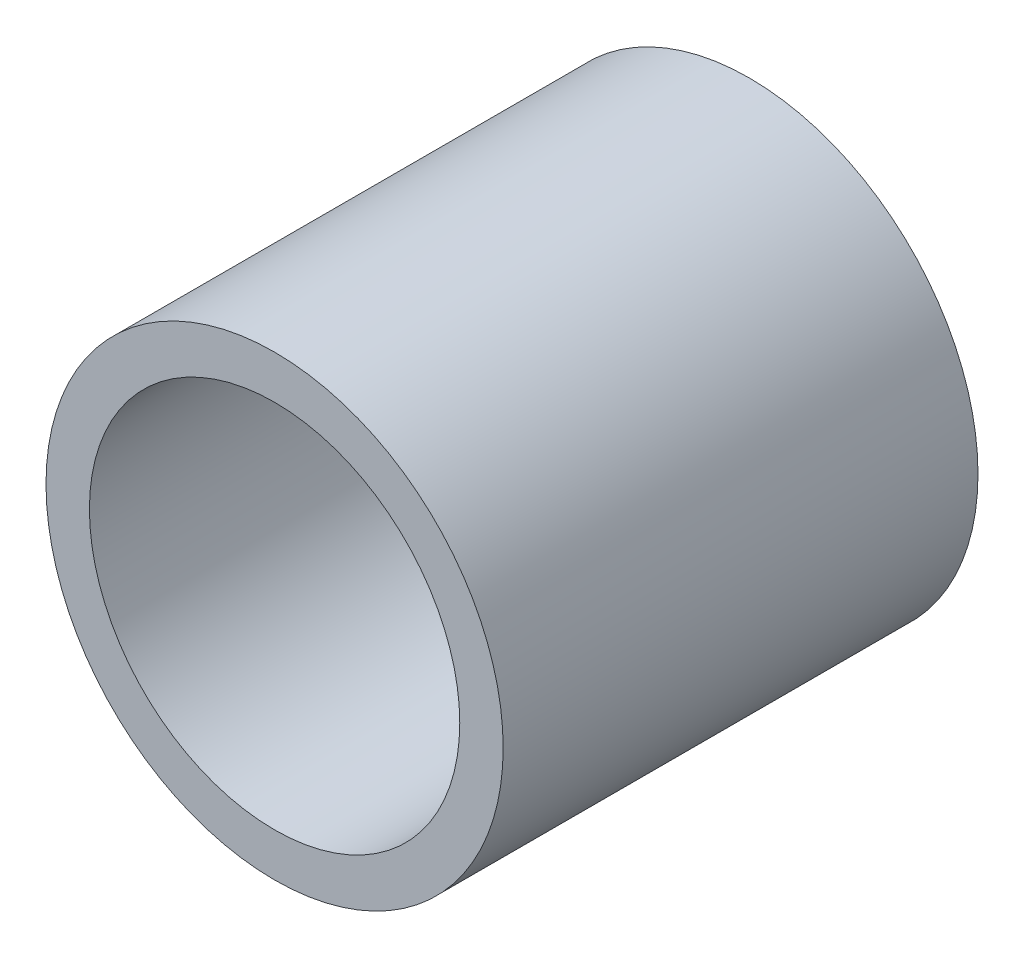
from build123d import *

# Parameters (mm, degrees)
SKETCH1_R      = 16.85
SKETCH1_R_2    = 13.65
EXTRUDE1_DEPTH = 17.5


with BuildPart() as part:
    # Sketch1 → Extrude1 (new, symmetric)
    with BuildSketch(Plane.XY):
        Circle(SKETCH1_R)
        Circle(SKETCH1_R_2, mode=Mode.SUBTRACT)
    extrude(amount=EXTRUDE1_DEPTH, both=True)


solid = part.part
